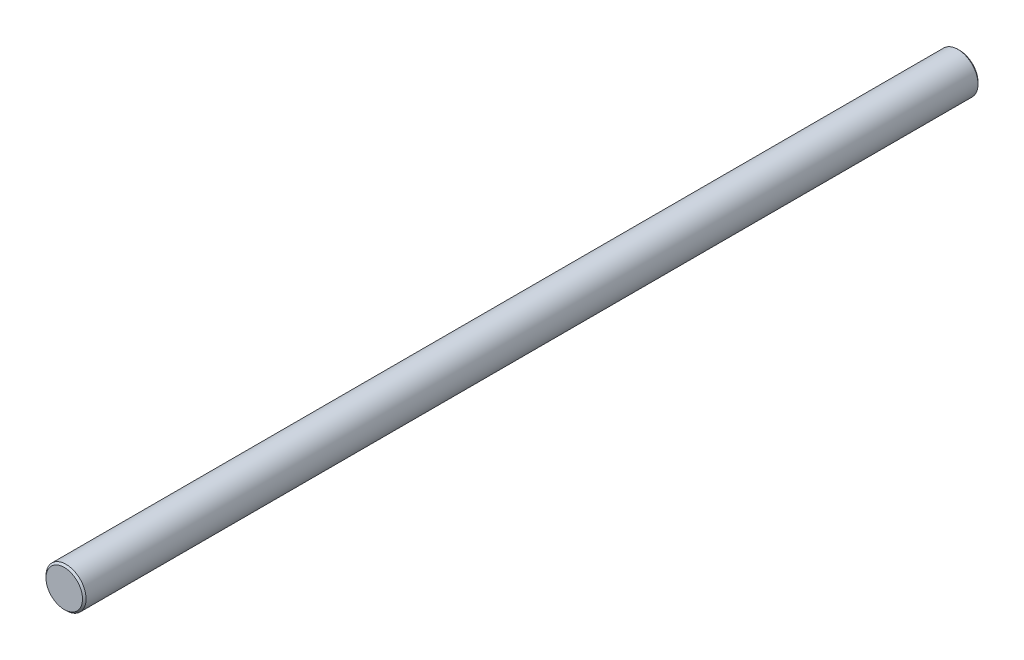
ISO-10303-21;
HEADER;
FILE_DESCRIPTION(('STEP AP214'),'2;1');
FILE_NAME('part.step','',(''),(''),'','','');
FILE_SCHEMA(('AUTOMOTIVE_DESIGN { 1 0 10303 214 1 1 1 1 }'));
ENDSEC;
DATA;
#1=APPLICATION_CONTEXT('core data for automotive mechanical design processes');
#2=APPLICATION_PROTOCOL_DEFINITION('international standard','automotive_design',2000,#1);
#3=PRODUCT_CONTEXT('',#1,'mechanical');
#4=PRODUCT('Part','Part','',(#3));
#5=PRODUCT_RELATED_PRODUCT_CATEGORY('part','',(#4));
#6=PRODUCT_DEFINITION_FORMATION('','',#4);
#7=PRODUCT_DEFINITION_CONTEXT('part definition',#1,'design');
#8=PRODUCT_DEFINITION('design','',#6,#7);
#9=PRODUCT_DEFINITION_SHAPE('','',#8);
#10=(LENGTH_UNIT() NAMED_UNIT(*) SI_UNIT(.MILLI.,.METRE.));
#11=(NAMED_UNIT(*) PLANE_ANGLE_UNIT() SI_UNIT($,.RADIAN.));
#12=(NAMED_UNIT(*) SI_UNIT($,.STERADIAN.) SOLID_ANGLE_UNIT());
#13=UNCERTAINTY_MEASURE_WITH_UNIT(LENGTH_MEASURE(1.E-05),#10,'distance_accuracy_value','');
#14=(GEOMETRIC_REPRESENTATION_CONTEXT(3) GLOBAL_UNCERTAINTY_ASSIGNED_CONTEXT((#13)) GLOBAL_UNIT_ASSIGNED_CONTEXT((#10,
#11,#12)) REPRESENTATION_CONTEXT('',''));
#15=CARTESIAN_POINT('',(0.,0.,0.));
#16=DIRECTION('',(0.,0.,1.));
#17=DIRECTION('',(1.,0.,0.));
#18=AXIS2_PLACEMENT_3D('',#15,#16,#17);
#19=CARTESIAN_POINT('',(0.,0.,63.5000000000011));
#20=DIRECTION('',(0.,0.,-1.));
#21=DIRECTION('',(-1.00000000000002,0.,0.));
#22=AXIS2_PLACEMENT_3D('',#19,#20,#21);
#23=CYLINDRICAL_SURFACE('',#22,1.4224);
#24=CARTESIAN_POINT('',(1.66533453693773E-13,0.,63.373000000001));
#25=DIRECTION('',(0.,0.,1.));
#26=DIRECTION('',(1.00000000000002,0.,0.));
#27=AXIS2_PLACEMENT_3D('',#24,#25,#26);
#28=CIRCLE('',#27,1.4224);
#29=CARTESIAN_POINT('',(1.42240000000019,0.,63.373000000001));
#30=VERTEX_POINT('',#29);
#31=EDGE_CURVE('E36',#30,#30,#28,.F.);
#32=ORIENTED_EDGE('',*,*,#31,.T.);
#33=EDGE_LOOP('',(#32));
#34=FACE_BOUND('',#33,.T.);
#35=CARTESIAN_POINT('',(0.,-1.11022302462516E-13,0.127000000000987));
#36=DIRECTION('',(0.,0.,1.));
#37=DIRECTION('',(1.00000000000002,0.,0.));
#38=AXIS2_PLACEMENT_3D('',#35,#36,#37);
#39=CIRCLE('',#38,1.4224);
#40=CARTESIAN_POINT('',(1.42239999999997,-1.10588027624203E-13,0.127000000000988));
#41=VERTEX_POINT('',#40);
#42=EDGE_CURVE('E40',#41,#41,#39,.T.);
#43=ORIENTED_EDGE('',*,*,#42,.T.);
#44=EDGE_LOOP('',(#43));
#45=FACE_BOUND('',#44,.T.);
#46=ADVANCED_FACE('F30',(#34,#45),#23,.T.);
#47=CARTESIAN_POINT('',(0.,0.,63.5000000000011));
#48=DIRECTION('',(0.,0.,1.));
#49=DIRECTION('',(1.00000000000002,0.,0.));
#50=AXIS2_PLACEMENT_3D('',#47,#48,#49);
#51=PLANE('',#50);
#52=CARTESIAN_POINT('',(0.,0.,63.5000000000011));
#53=DIRECTION('',(0.,0.,1.));
#54=DIRECTION('',(1.00000000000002,0.,0.));
#55=AXIS2_PLACEMENT_3D('',#52,#53,#54);
#56=CIRCLE('',#55,1.2954);
#57=CARTESIAN_POINT('',(1.29540000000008,0.,63.5000000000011));
#58=VERTEX_POINT('',#57);
#59=EDGE_CURVE('E44',#58,#58,#56,.T.);
#60=ORIENTED_EDGE('',*,*,#59,.T.);
#61=EDGE_LOOP('',(#60));
#62=FACE_BOUND('',#61,.T.);
#63=ADVANCED_FACE('F50',(#62),#51,.T.);
#64=CARTESIAN_POINT('',(-1.66533453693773E-13,0.,0.));
#65=DIRECTION('',(0.,0.,1.));
#66=DIRECTION('',(1.00000000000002,0.,0.));
#67=AXIS2_PLACEMENT_3D('',#64,#65,#66);
#68=PLANE('',#67);
#69=CARTESIAN_POINT('',(-1.66533453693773E-13,0.,0.));
#70=DIRECTION('',(0.,0.,1.));
#71=DIRECTION('',(1.00000000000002,0.,0.));
#72=AXIS2_PLACEMENT_3D('',#69,#70,#71);
#73=CIRCLE('',#72,1.2954);
#74=CARTESIAN_POINT('',(1.29539999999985,0.,0.));
#75=VERTEX_POINT('',#74);
#76=EDGE_CURVE('E10',#75,#75,#73,.F.);
#77=ORIENTED_EDGE('',*,*,#76,.T.);
#78=EDGE_LOOP('',(#77));
#79=FACE_BOUND('',#78,.T.);
#80=ADVANCED_FACE('F55',(#79),#68,.F.);
#81=CARTESIAN_POINT('',(0.,0.,63.5000000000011));
#82=DIRECTION('',(0.,0.,-1.));
#83=DIRECTION('',(-1.00000000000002,0.,0.));
#84=AXIS2_PLACEMENT_3D('',#81,#82,#83);
#85=CONICAL_SURFACE('',#84,1.2954,0.785398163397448);
#86=ORIENTED_EDGE('',*,*,#31,.F.);
#87=EDGE_LOOP('',(#86));
#88=FACE_BOUND('',#87,.T.);
#89=ORIENTED_EDGE('',*,*,#59,.F.);
#90=EDGE_LOOP('',(#89));
#91=FACE_BOUND('',#90,.T.);
#92=ADVANCED_FACE('F52',(#88,#91),#85,.T.);
#93=CARTESIAN_POINT('',(0.,-1.11022302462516E-13,0.127000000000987));
#94=DIRECTION('',(0.,0.,1.));
#95=DIRECTION('',(1.00000000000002,0.,0.));
#96=AXIS2_PLACEMENT_3D('',#93,#94,#95);
#97=CONICAL_SURFACE('',#96,1.4224,0.785398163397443);
#98=ORIENTED_EDGE('',*,*,#76,.F.);
#99=EDGE_LOOP('',(#98));
#100=FACE_BOUND('',#99,.T.);
#101=ORIENTED_EDGE('',*,*,#42,.F.);
#102=EDGE_LOOP('',(#101));
#103=FACE_BOUND('',#102,.T.);
#104=ADVANCED_FACE('F54',(#100,#103),#97,.T.);
#105=CLOSED_SHELL('',(#46,#63,#80,#92,#104));
#106=MANIFOLD_SOLID_BREP('B2',#105);
#107=ADVANCED_BREP_SHAPE_REPRESENTATION('',(#18,#106),#14);
#108=SHAPE_DEFINITION_REPRESENTATION(#9,#107);
ENDSEC;
END-ISO-10303-21;
